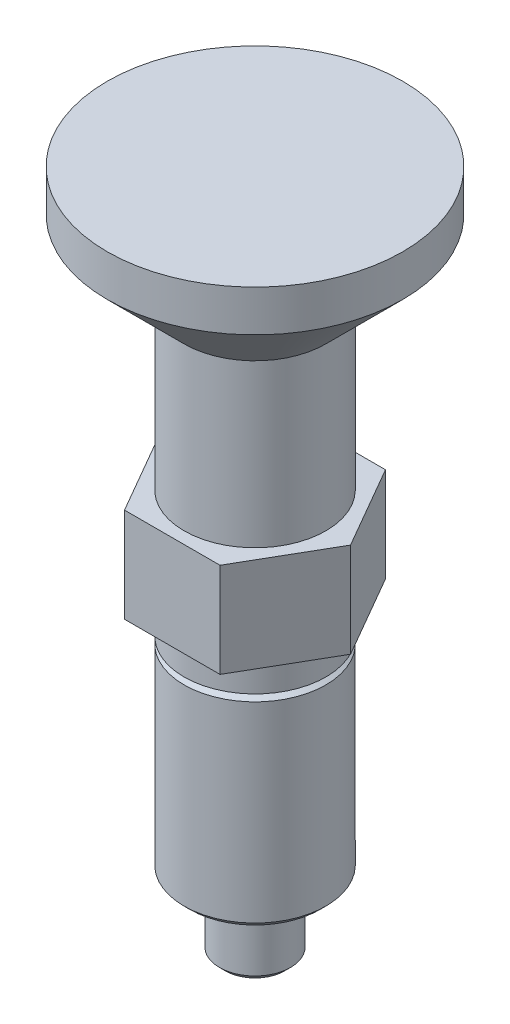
ISO-10303-21;
HEADER;
FILE_DESCRIPTION(('STEP AP214'),'2;1');
FILE_NAME('part.step','',(''),(''),'','','');
FILE_SCHEMA(('AUTOMOTIVE_DESIGN { 1 0 10303 214 1 1 1 1 }'));
ENDSEC;
DATA;
#1=APPLICATION_CONTEXT('core data for automotive mechanical design processes');
#2=APPLICATION_PROTOCOL_DEFINITION('international standard','automotive_design',2000,#1);
#3=PRODUCT_CONTEXT('',#1,'mechanical');
#4=PRODUCT('Part','Part','',(#3));
#5=PRODUCT_RELATED_PRODUCT_CATEGORY('part','',(#4));
#6=PRODUCT_DEFINITION_FORMATION('','',#4);
#7=PRODUCT_DEFINITION_CONTEXT('part definition',#1,'design');
#8=PRODUCT_DEFINITION('design','',#6,#7);
#9=PRODUCT_DEFINITION_SHAPE('','',#8);
#10=(LENGTH_UNIT() NAMED_UNIT(*) SI_UNIT(.MILLI.,.METRE.));
#11=(NAMED_UNIT(*) PLANE_ANGLE_UNIT() SI_UNIT($,.RADIAN.));
#12=(NAMED_UNIT(*) SI_UNIT($,.STERADIAN.) SOLID_ANGLE_UNIT());
#13=UNCERTAINTY_MEASURE_WITH_UNIT(LENGTH_MEASURE(1.E-05),#10,'distance_accuracy_value','');
#14=(GEOMETRIC_REPRESENTATION_CONTEXT(3) GLOBAL_UNCERTAINTY_ASSIGNED_CONTEXT((#13)) GLOBAL_UNIT_ASSIGNED_CONTEXT((#10,
#11,#12)) REPRESENTATION_CONTEXT('',''));
#15=CARTESIAN_POINT('',(0.,0.,0.));
#16=DIRECTION('',(0.,0.,1.));
#17=DIRECTION('',(1.,0.,0.));
#18=AXIS2_PLACEMENT_3D('',#15,#16,#17);
#19=CARTESIAN_POINT('',(0.,-6.,0.));
#20=DIRECTION('',(0.,-1.,0.));
#21=DIRECTION('',(0.,0.,-1.));
#22=AXIS2_PLACEMENT_3D('',#19,#20,#21);
#23=PLANE('',#22);
#24=CARTESIAN_POINT('',(0.,-6.00000000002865,0.));
#25=DIRECTION('',(0.,1.,0.));
#26=DIRECTION('',(0.,0.,1.));
#27=AXIS2_PLACEMENT_3D('',#24,#25,#26);
#28=CIRCLE('',#27,2.49999999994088);
#29=CARTESIAN_POINT('',(0.,-6.00000000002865,2.49999999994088));
#30=VERTEX_POINT('',#29);
#31=EDGE_CURVE('E19',#30,#30,#28,.T.);
#32=ORIENTED_EDGE('',*,*,#31,.F.);
#33=EDGE_LOOP('',(#32));
#34=FACE_BOUND('',#33,.T.);
#35=ADVANCED_FACE('F16',(#34),#23,.T.);
#36=CARTESIAN_POINT('',(0.,-5.50000000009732,0.));
#37=DIRECTION('',(0.,1.,0.));
#38=DIRECTION('',(0.,0.,1.));
#39=AXIS2_PLACEMENT_3D('',#36,#37,#38);
#40=CONICAL_SURFACE('',#39,2.99999999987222,0.785398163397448);
#41=ORIENTED_EDGE('',*,*,#31,.T.);
#42=EDGE_LOOP('',(#41));
#43=FACE_BOUND('',#42,.T.);
#44=CARTESIAN_POINT('',(0.,-5.49999999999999,0.));
#45=DIRECTION('',(0.,1.,0.));
#46=DIRECTION('',(0.,0.,1.));
#47=AXIS2_PLACEMENT_3D('',#44,#45,#46);
#48=CIRCLE('',#47,2.99999999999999);
#49=CARTESIAN_POINT('',(0.,-5.49999999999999,2.99999999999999));
#50=VERTEX_POINT('',#49);
#51=EDGE_CURVE('E110',#50,#50,#48,.T.);
#52=ORIENTED_EDGE('',*,*,#51,.F.);
#53=EDGE_LOOP('',(#52));
#54=FACE_BOUND('',#53,.T.);
#55=ADVANCED_FACE('F130',(#43,#54),#40,.T.);
#56=CARTESIAN_POINT('',(0.,57.7629759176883,0.));
#57=DIRECTION('',(0.,1.,0.));
#58=DIRECTION('',(0.,0.,1.));
#59=AXIS2_PLACEMENT_3D('',#56,#57,#58);
#60=CYLINDRICAL_SURFACE('',#59,2.99999999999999);
#61=ORIENTED_EDGE('',*,*,#51,.T.);
#62=EDGE_LOOP('',(#61));
#63=FACE_BOUND('',#62,.T.);
#64=CARTESIAN_POINT('',(0.,0.,0.));
#65=DIRECTION('',(0.,1.,0.));
#66=DIRECTION('',(0.,0.,1.));
#67=AXIS2_PLACEMENT_3D('',#64,#65,#66);
#68=CIRCLE('',#67,2.99999999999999);
#69=CARTESIAN_POINT('',(0.,0.,2.99999999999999));
#70=VERTEX_POINT('',#69);
#71=EDGE_CURVE('E112',#70,#70,#68,.T.);
#72=ORIENTED_EDGE('',*,*,#71,.F.);
#73=EDGE_LOOP('',(#72));
#74=FACE_BOUND('',#73,.T.);
#75=ADVANCED_FACE('F128',(#63,#74),#60,.T.);
#76=CARTESIAN_POINT('',(-2.99999999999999,0.,0.));
#77=DIRECTION('',(0.,-1.,0.));
#78=DIRECTION('',(0.,0.,-1.));
#79=AXIS2_PLACEMENT_3D('',#76,#77,#78);
#80=PLANE('',#79);
#81=ORIENTED_EDGE('',*,*,#71,.T.);
#82=EDGE_LOOP('',(#81));
#83=FACE_BOUND('',#82,.T.);
#84=CARTESIAN_POINT('',(0.,5.6843418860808E-11,0.));
#85=DIRECTION('',(0.,1.,0.));
#86=DIRECTION('',(0.,0.,1.));
#87=AXIS2_PLACEMENT_3D('',#84,#85,#86);
#88=CIRCLE('',#87,5.49999999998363);
#89=CARTESIAN_POINT('',(0.,5.6843418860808E-11,5.49999999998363));
#90=VERTEX_POINT('',#89);
#91=EDGE_CURVE('E109',#90,#90,#88,.T.);
#92=ORIENTED_EDGE('',*,*,#91,.F.);
#93=EDGE_LOOP('',(#92));
#94=FACE_BOUND('',#93,.T.);
#95=ADVANCED_FACE('F125',(#83,#94),#80,.T.);
#96=CARTESIAN_POINT('',(0.,0.50000000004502,0.));
#97=DIRECTION('',(0.,1.,0.));
#98=DIRECTION('',(0.,0.,1.));
#99=AXIS2_PLACEMENT_3D('',#96,#97,#98);
#100=CONICAL_SURFACE('',#99,5.99999999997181,0.785398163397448);
#101=ORIENTED_EDGE('',*,*,#91,.T.);
#102=EDGE_LOOP('',(#101));
#103=FACE_BOUND('',#102,.T.);
#104=CARTESIAN_POINT('',(0.,0.5,0.));
#105=DIRECTION('',(0.,1.,0.));
#106=DIRECTION('',(0.,0.,1.));
#107=AXIS2_PLACEMENT_3D('',#104,#105,#106);
#108=CIRCLE('',#107,5.99999999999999);
#109=CARTESIAN_POINT('',(0.,0.5,5.99999999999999));
#110=VERTEX_POINT('',#109);
#111=EDGE_CURVE('E106',#110,#110,#108,.T.);
#112=ORIENTED_EDGE('',*,*,#111,.F.);
#113=EDGE_LOOP('',(#112));
#114=FACE_BOUND('',#113,.T.);
#115=ADVANCED_FACE('F138',(#103,#114),#100,.T.);
#116=CARTESIAN_POINT('',(0.,57.7629759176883,0.));
#117=DIRECTION('',(0.,1.,0.));
#118=DIRECTION('',(0.,0.,1.));
#119=AXIS2_PLACEMENT_3D('',#116,#117,#118);
#120=CYLINDRICAL_SURFACE('',#119,5.99999999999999);
#121=ORIENTED_EDGE('',*,*,#111,.T.);
#122=EDGE_LOOP('',(#121));
#123=FACE_BOUND('',#122,.T.);
#124=CARTESIAN_POINT('',(0.,16.7113248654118,0.));
#125=DIRECTION('',(0.,-1.,0.));
#126=DIRECTION('',(0.,0.,-1.));
#127=AXIS2_PLACEMENT_3D('',#124,#125,#126);
#128=CIRCLE('',#127,6.00000000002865);
#129=CARTESIAN_POINT('',(0.,16.7113248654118,-6.00000000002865));
#130=VERTEX_POINT('',#129);
#131=EDGE_CURVE('E103',#130,#130,#128,.F.);
#132=ORIENTED_EDGE('',*,*,#131,.F.);
#133=EDGE_LOOP('',(#132));
#134=FACE_BOUND('',#133,.T.);
#135=ADVANCED_FACE('F196',(#123,#134),#120,.T.);
#136=CARTESIAN_POINT('',(0.,16.7113248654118,0.));
#137=DIRECTION('',(0.,-1.,0.));
#138=DIRECTION('',(0.,0.,-1.));
#139=AXIS2_PLACEMENT_3D('',#136,#137,#138);
#140=CONICAL_SURFACE('',#139,6.00000000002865,1.04719755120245);
#141=CARTESIAN_POINT('',(0.,16.9999999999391,0.));
#142=DIRECTION('',(0.,1.,0.));
#143=DIRECTION('',(0.,0.,1.));
#144=AXIS2_PLACEMENT_3D('',#141,#142,#143);
#145=CIRCLE('',#144,5.49999999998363);
#146=CARTESIAN_POINT('',(0.,16.9999999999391,5.49999999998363));
#147=VERTEX_POINT('',#146);
#148=EDGE_CURVE('E100',#147,#147,#145,.T.);
#149=ORIENTED_EDGE('',*,*,#148,.F.);
#150=EDGE_LOOP('',(#149));
#151=FACE_BOUND('',#150,.T.);
#152=ORIENTED_EDGE('',*,*,#131,.T.);
#153=EDGE_LOOP('',(#152));
#154=FACE_BOUND('',#153,.T.);
#155=ADVANCED_FACE('F192',(#151,#154),#140,.T.);
#156=CARTESIAN_POINT('',(0.,17.28867513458,0.));
#157=DIRECTION('',(0.,1.,0.));
#158=DIRECTION('',(0.,0.,1.));
#159=AXIS2_PLACEMENT_3D('',#156,#157,#158);
#160=CONICAL_SURFACE('',#159,6.00000000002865,1.04719755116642);
#161=ORIENTED_EDGE('',*,*,#148,.T.);
#162=EDGE_LOOP('',(#161));
#163=FACE_BOUND('',#162,.T.);
#164=CARTESIAN_POINT('',(0.,17.2886751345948,0.));
#165=DIRECTION('',(0.,1.,0.));
#166=DIRECTION('',(0.,0.,1.));
#167=AXIS2_PLACEMENT_3D('',#164,#165,#166);
#168=CIRCLE('',#167,5.99999999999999);
#169=CARTESIAN_POINT('',(0.,17.2886751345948,5.99999999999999));
#170=VERTEX_POINT('',#169);
#171=EDGE_CURVE('E97',#170,#170,#168,.T.);
#172=ORIENTED_EDGE('',*,*,#171,.F.);
#173=EDGE_LOOP('',(#172));
#174=FACE_BOUND('',#173,.T.);
#175=ADVANCED_FACE('F188',(#163,#174),#160,.T.);
#176=CARTESIAN_POINT('',(0.,57.7629759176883,0.));
#177=DIRECTION('',(0.,1.,0.));
#178=DIRECTION('',(0.,0.,1.));
#179=AXIS2_PLACEMENT_3D('',#176,#177,#178);
#180=CYLINDRICAL_SURFACE('',#179,5.99999999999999);
#181=ORIENTED_EDGE('',*,*,#171,.T.);
#182=EDGE_LOOP('',(#181));
#183=FACE_BOUND('',#182,.T.);
#184=CARTESIAN_POINT('',(0.,20.,0.));
#185=DIRECTION('',(0.,1.,0.));
#186=DIRECTION('',(0.,0.,1.));
#187=AXIS2_PLACEMENT_3D('',#184,#185,#186);
#188=CIRCLE('',#187,5.99999999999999);
#189=CARTESIAN_POINT('',(0.,20.,5.99999999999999));
#190=VERTEX_POINT('',#189);
#191=EDGE_CURVE('E80',#190,#190,#188,.T.);
#192=ORIENTED_EDGE('',*,*,#191,.F.);
#193=EDGE_LOOP('',(#192));
#194=FACE_BOUND('',#193,.T.);
#195=ADVANCED_FACE('F185',(#183,#194),#180,.T.);
#196=CARTESIAN_POINT('',(-5.99999999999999,20.,0.));
#197=DIRECTION('',(0.,-1.,0.));
#198=DIRECTION('',(0.,0.,-1.));
#199=AXIS2_PLACEMENT_3D('',#196,#197,#198);
#200=PLANE('',#199);
#201=DIRECTION('',(0.5,0.,0.866025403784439));
#202=VECTOR('',#201,1.);
#203=CARTESIAN_POINT('',(-4.04145188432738,20.,7.));
#204=LINE('',#203,#202);
#205=CARTESIAN_POINT('',(-8.08290376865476,20.,0.));
#206=VERTEX_POINT('',#205);
#207=CARTESIAN_POINT('',(-4.04145188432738,20.,7.));
#208=VERTEX_POINT('',#207);
#209=EDGE_CURVE('E360',#206,#208,#204,.T.);
#210=ORIENTED_EDGE('',*,*,#209,.F.);
#211=DIRECTION('',(-0.5,0.,0.866025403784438));
#212=VECTOR('',#211,1.);
#213=CARTESIAN_POINT('',(-8.08290376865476,20.,0.));
#214=LINE('',#213,#212);
#215=CARTESIAN_POINT('',(-4.04145188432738,20.,-7.));
#216=VERTEX_POINT('',#215);
#217=EDGE_CURVE('E359',#216,#206,#214,.T.);
#218=ORIENTED_EDGE('',*,*,#217,.F.);
#219=DIRECTION('',(-1.,0.,0.));
#220=VECTOR('',#219,1.);
#221=CARTESIAN_POINT('',(-4.04145188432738,20.,-7.));
#222=LINE('',#221,#220);
#223=CARTESIAN_POINT('',(4.04145188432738,20.,-7.));
#224=VERTEX_POINT('',#223);
#225=EDGE_CURVE('E86',#224,#216,#222,.T.);
#226=ORIENTED_EDGE('',*,*,#225,.F.);
#227=DIRECTION('',(-0.5,0.,-0.866025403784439));
#228=VECTOR('',#227,1.);
#229=CARTESIAN_POINT('',(4.04145188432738,20.,-7.));
#230=LINE('',#229,#228);
#231=CARTESIAN_POINT('',(8.08290376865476,20.,0.));
#232=VERTEX_POINT('',#231);
#233=EDGE_CURVE('E66',#232,#224,#230,.T.);
#234=ORIENTED_EDGE('',*,*,#233,.F.);
#235=DIRECTION('',(0.5,0.,-0.866025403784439));
#236=VECTOR('',#235,1.);
#237=CARTESIAN_POINT('',(8.08290376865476,20.,0.));
#238=LINE('',#237,#236);
#239=CARTESIAN_POINT('',(4.04145188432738,20.,7.));
#240=VERTEX_POINT('',#239);
#241=EDGE_CURVE('E71',#240,#232,#238,.T.);
#242=ORIENTED_EDGE('',*,*,#241,.F.);
#243=DIRECTION('',(1.,0.,0.));
#244=VECTOR('',#243,1.);
#245=CARTESIAN_POINT('',(4.04145188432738,20.,7.));
#246=LINE('',#245,#244);
#247=EDGE_CURVE('E372',#208,#240,#246,.T.);
#248=ORIENTED_EDGE('',*,*,#247,.F.);
#249=EDGE_LOOP('',(#210,#218,#226,#234,#242,#248));
#250=FACE_BOUND('',#249,.T.);
#251=ORIENTED_EDGE('',*,*,#191,.T.);
#252=EDGE_LOOP('',(#251));
#253=FACE_BOUND('',#252,.T.);
#254=ADVANCED_FACE('F83',(#250,#253),#200,.T.);
#255=CARTESIAN_POINT('',(8.08290376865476,64.7695526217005,0.));
#256=DIRECTION('',(0.866025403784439,0.,0.5));
#257=DIRECTION('',(0.5,0.,-0.866025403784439));
#258=AXIS2_PLACEMENT_3D('',#255,#256,#257);
#259=PLANE('',#258);
#260=ORIENTED_EDGE('',*,*,#241,.T.);
#261=DIRECTION('',(0.,1.,0.));
#262=VECTOR('',#261,1.);
#263=CARTESIAN_POINT('',(8.08290376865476,64.7695526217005,0.));
#264=LINE('',#263,#262);
#265=CARTESIAN_POINT('',(8.08290376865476,28.,0.));
#266=VERTEX_POINT('',#265);
#267=EDGE_CURVE('E73',#266,#232,#264,.F.);
#268=ORIENTED_EDGE('',*,*,#267,.F.);
#269=DIRECTION('',(0.500000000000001,0.,-0.866025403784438));
#270=VECTOR('',#269,1.);
#271=CARTESIAN_POINT('',(4.04145188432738,28.,7.));
#272=LINE('',#271,#270);
#273=CARTESIAN_POINT('',(4.04145188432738,28.,7.));
#274=VERTEX_POINT('',#273);
#275=EDGE_CURVE('E375',#274,#266,#272,.T.);
#276=ORIENTED_EDGE('',*,*,#275,.F.);
#277=DIRECTION('',(0.,1.,0.));
#278=VECTOR('',#277,1.);
#279=CARTESIAN_POINT('',(4.04145188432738,64.7695526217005,7.));
#280=LINE('',#279,#278);
#281=EDGE_CURVE('E76',#240,#274,#280,.T.);
#282=ORIENTED_EDGE('',*,*,#281,.F.);
#283=EDGE_LOOP('',(#260,#268,#276,#282));
#284=FACE_BOUND('',#283,.T.);
#285=ADVANCED_FACE('F72',(#284),#259,.T.);
#286=CARTESIAN_POINT('',(4.04145188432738,64.7695526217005,-7.));
#287=DIRECTION('',(0.866025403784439,0.,-0.5));
#288=DIRECTION('',(-0.5,0.,-0.866025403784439));
#289=AXIS2_PLACEMENT_3D('',#286,#287,#288);
#290=PLANE('',#289);
#291=ORIENTED_EDGE('',*,*,#233,.T.);
#292=DIRECTION('',(0.,1.,0.));
#293=VECTOR('',#292,1.);
#294=CARTESIAN_POINT('',(4.04145188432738,64.7695526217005,-7.));
#295=LINE('',#294,#293);
#296=CARTESIAN_POINT('',(4.04145188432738,28.,-7.));
#297=VERTEX_POINT('',#296);
#298=EDGE_CURVE('E88',#297,#224,#295,.F.);
#299=ORIENTED_EDGE('',*,*,#298,.F.);
#300=DIRECTION('',(-0.5,0.,-0.866025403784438));
#301=VECTOR('',#300,1.);
#302=CARTESIAN_POINT('',(8.08290376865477,28.,0.));
#303=LINE('',#302,#301);
#304=EDGE_CURVE('E92',#266,#297,#303,.T.);
#305=ORIENTED_EDGE('',*,*,#304,.F.);
#306=ORIENTED_EDGE('',*,*,#267,.T.);
#307=EDGE_LOOP('',(#291,#299,#305,#306));
#308=FACE_BOUND('',#307,.T.);
#309=ADVANCED_FACE('F90',(#308),#290,.T.);
#310=CARTESIAN_POINT('',(-4.04145188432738,64.7695526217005,-7.));
#311=DIRECTION('',(0.,0.,-1.));
#312=DIRECTION('',(-1.,0.,0.));
#313=AXIS2_PLACEMENT_3D('',#310,#311,#312);
#314=PLANE('',#313);
#315=ORIENTED_EDGE('',*,*,#225,.T.);
#316=DIRECTION('',(0.,1.,0.));
#317=VECTOR('',#316,1.);
#318=CARTESIAN_POINT('',(-4.04145188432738,64.7695526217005,-7.));
#319=LINE('',#318,#317);
#320=CARTESIAN_POINT('',(-4.04145188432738,28.,-7.));
#321=VERTEX_POINT('',#320);
#322=EDGE_CURVE('E356',#321,#216,#319,.F.);
#323=ORIENTED_EDGE('',*,*,#322,.F.);
#324=DIRECTION('',(1.,0.,0.));
#325=VECTOR('',#324,1.);
#326=CARTESIAN_POINT('',(-13.,28.,-7.));
#327=LINE('',#326,#325);
#328=EDGE_CURVE('E378',#297,#321,#327,.F.);
#329=ORIENTED_EDGE('',*,*,#328,.F.);
#330=ORIENTED_EDGE('',*,*,#298,.T.);
#331=EDGE_LOOP('',(#315,#323,#329,#330));
#332=FACE_BOUND('',#331,.T.);
#333=ADVANCED_FACE('F174',(#332),#314,.T.);
#334=CARTESIAN_POINT('',(-8.08290376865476,64.7695526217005,0.));
#335=DIRECTION('',(-0.866025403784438,0.,-0.5));
#336=DIRECTION('',(-0.5,0.,0.866025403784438));
#337=AXIS2_PLACEMENT_3D('',#334,#335,#336);
#338=PLANE('',#337);
#339=ORIENTED_EDGE('',*,*,#217,.T.);
#340=DIRECTION('',(0.,1.,0.));
#341=VECTOR('',#340,1.);
#342=CARTESIAN_POINT('',(-8.08290376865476,64.7695526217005,0.));
#343=LINE('',#342,#341);
#344=CARTESIAN_POINT('',(-8.08290376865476,28.,0.));
#345=VERTEX_POINT('',#344);
#346=EDGE_CURVE('E362',#345,#206,#343,.F.);
#347=ORIENTED_EDGE('',*,*,#346,.F.);
#348=DIRECTION('',(-0.5,0.,0.866025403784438));
#349=VECTOR('',#348,1.);
#350=CARTESIAN_POINT('',(-4.04145188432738,28.,-7.));
#351=LINE('',#350,#349);
#352=EDGE_CURVE('E365',#321,#345,#351,.T.);
#353=ORIENTED_EDGE('',*,*,#352,.F.);
#354=ORIENTED_EDGE('',*,*,#322,.T.);
#355=EDGE_LOOP('',(#339,#347,#353,#354));
#356=FACE_BOUND('',#355,.T.);
#357=ADVANCED_FACE('F171',(#356),#338,.T.);
#358=CARTESIAN_POINT('',(-4.04145188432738,64.7695526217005,7.));
#359=DIRECTION('',(-0.866025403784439,0.,0.5));
#360=DIRECTION('',(0.5,0.,0.866025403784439));
#361=AXIS2_PLACEMENT_3D('',#358,#359,#360);
#362=PLANE('',#361);
#363=ORIENTED_EDGE('',*,*,#209,.T.);
#364=DIRECTION('',(0.,1.,0.));
#365=VECTOR('',#364,1.);
#366=CARTESIAN_POINT('',(-4.04145188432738,64.7695526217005,7.));
#367=LINE('',#366,#365);
#368=CARTESIAN_POINT('',(-4.04145188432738,28.,7.));
#369=VERTEX_POINT('',#368);
#370=EDGE_CURVE('E34',#369,#208,#367,.F.);
#371=ORIENTED_EDGE('',*,*,#370,.F.);
#372=DIRECTION('',(0.5,0.,0.866025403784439));
#373=VECTOR('',#372,1.);
#374=CARTESIAN_POINT('',(-8.08290376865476,28.,0.));
#375=LINE('',#374,#373);
#376=EDGE_CURVE('E381',#345,#369,#375,.T.);
#377=ORIENTED_EDGE('',*,*,#376,.F.);
#378=ORIENTED_EDGE('',*,*,#346,.T.);
#379=EDGE_LOOP('',(#363,#371,#377,#378));
#380=FACE_BOUND('',#379,.T.);
#381=ADVANCED_FACE('F167',(#380),#362,.T.);
#382=CARTESIAN_POINT('',(4.04145188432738,64.7695526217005,7.));
#383=DIRECTION('',(0.,0.,1.));
#384=DIRECTION('',(1.,0.,0.));
#385=AXIS2_PLACEMENT_3D('',#382,#383,#384);
#386=PLANE('',#385);
#387=ORIENTED_EDGE('',*,*,#247,.T.);
#388=ORIENTED_EDGE('',*,*,#281,.T.);
#389=DIRECTION('',(1.,0.,0.));
#390=VECTOR('',#389,1.);
#391=CARTESIAN_POINT('',(-13.,28.,7.));
#392=LINE('',#391,#390);
#393=EDGE_CURVE('E118',#369,#274,#392,.T.);
#394=ORIENTED_EDGE('',*,*,#393,.F.);
#395=ORIENTED_EDGE('',*,*,#370,.T.);
#396=EDGE_LOOP('',(#387,#388,#394,#395));
#397=FACE_BOUND('',#396,.T.);
#398=ADVANCED_FACE('F163',(#397),#386,.T.);
#399=CARTESIAN_POINT('',(-13.,28.,0.));
#400=DIRECTION('',(0.,1.,0.));
#401=DIRECTION('',(0.,0.,1.));
#402=AXIS2_PLACEMENT_3D('',#399,#400,#401);
#403=PLANE('',#402);
#404=ORIENTED_EDGE('',*,*,#376,.T.);
#405=ORIENTED_EDGE('',*,*,#393,.T.);
#406=ORIENTED_EDGE('',*,*,#275,.T.);
#407=ORIENTED_EDGE('',*,*,#304,.T.);
#408=ORIENTED_EDGE('',*,*,#328,.T.);
#409=ORIENTED_EDGE('',*,*,#352,.T.);
#410=EDGE_LOOP('',(#404,#405,#406,#407,#408,#409));
#411=FACE_BOUND('',#410,.T.);
#412=CARTESIAN_POINT('',(0.,28.,0.));
#413=DIRECTION('',(0.,1.,0.));
#414=DIRECTION('',(0.,0.,1.));
#415=AXIS2_PLACEMENT_3D('',#412,#413,#414);
#416=CIRCLE('',#415,5.99999999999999);
#417=CARTESIAN_POINT('',(0.,28.,5.99999999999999));
#418=VERTEX_POINT('',#417);
#419=EDGE_CURVE('E114',#418,#418,#416,.T.);
#420=ORIENTED_EDGE('',*,*,#419,.F.);
#421=EDGE_LOOP('',(#420));
#422=FACE_BOUND('',#421,.T.);
#423=ADVANCED_FACE('F159',(#411,#422),#403,.T.);
#424=CARTESIAN_POINT('',(0.,57.7629759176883,0.));
#425=DIRECTION('',(0.,1.,0.));
#426=DIRECTION('',(0.,0.,1.));
#427=AXIS2_PLACEMENT_3D('',#424,#425,#426);
#428=CYLINDRICAL_SURFACE('',#427,5.99999999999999);
#429=ORIENTED_EDGE('',*,*,#419,.T.);
#430=EDGE_LOOP('',(#429));
#431=FACE_BOUND('',#430,.T.);
#432=CARTESIAN_POINT('',(0.,41.7,0.));
#433=DIRECTION('',(0.,1.,0.));
#434=DIRECTION('',(0.,0.,1.));
#435=AXIS2_PLACEMENT_3D('',#432,#433,#434);
#436=CIRCLE('',#435,5.99999999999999);
#437=CARTESIAN_POINT('',(0.,41.7,5.99999999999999));
#438=VERTEX_POINT('',#437);
#439=EDGE_CURVE('E117',#438,#438,#436,.T.);
#440=ORIENTED_EDGE('',*,*,#439,.F.);
#441=EDGE_LOOP('',(#440));
#442=FACE_BOUND('',#441,.T.);
#443=ADVANCED_FACE('F155',(#431,#442),#428,.T.);
#444=CARTESIAN_POINT('',(0.,48.2,0.));
#445=DIRECTION('',(0.,1.,0.));
#446=DIRECTION('',(-1.,0.,0.));
#447=AXIS2_PLACEMENT_3D('',#444,#445,#446);
#448=CONICAL_SURFACE('',#447,12.5,0.785398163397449);
#449=ORIENTED_EDGE('',*,*,#439,.T.);
#450=EDGE_LOOP('',(#449));
#451=FACE_BOUND('',#450,.T.);
#452=CARTESIAN_POINT('',(0.,48.2,0.));
#453=DIRECTION('',(0.,1.,0.));
#454=DIRECTION('',(0.,0.,1.));
#455=AXIS2_PLACEMENT_3D('',#452,#453,#454);
#456=CIRCLE('',#455,12.5);
#457=CARTESIAN_POINT('',(0.,48.2,12.5));
#458=VERTEX_POINT('',#457);
#459=EDGE_CURVE('E25',#458,#458,#456,.T.);
#460=ORIENTED_EDGE('',*,*,#459,.F.);
#461=EDGE_LOOP('',(#460));
#462=FACE_BOUND('',#461,.T.);
#463=ADVANCED_FACE('F149',(#451,#462),#448,.T.);
#464=CARTESIAN_POINT('',(0.,57.7629759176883,0.));
#465=DIRECTION('',(0.,1.,0.));
#466=DIRECTION('',(0.,0.,1.));
#467=AXIS2_PLACEMENT_3D('',#464,#465,#466);
#468=CYLINDRICAL_SURFACE('',#467,12.5);
#469=ORIENTED_EDGE('',*,*,#459,.T.);
#470=EDGE_LOOP('',(#469));
#471=FACE_BOUND('',#470,.T.);
#472=CARTESIAN_POINT('',(0.,51.7,0.));
#473=DIRECTION('',(0.,1.,0.));
#474=DIRECTION('',(0.,0.,1.));
#475=AXIS2_PLACEMENT_3D('',#472,#473,#474);
#476=CIRCLE('',#475,12.5);
#477=CARTESIAN_POINT('',(0.,51.7,12.5));
#478=VERTEX_POINT('',#477);
#479=EDGE_CURVE('E11',#478,#478,#476,.T.);
#480=ORIENTED_EDGE('',*,*,#479,.F.);
#481=EDGE_LOOP('',(#480));
#482=FACE_BOUND('',#481,.T.);
#483=ADVANCED_FACE('F143',(#471,#482),#468,.T.);
#484=CARTESIAN_POINT('',(-12.5,51.7,0.));
#485=DIRECTION('',(0.,1.,0.));
#486=DIRECTION('',(0.,0.,1.));
#487=AXIS2_PLACEMENT_3D('',#484,#485,#486);
#488=PLANE('',#487);
#489=ORIENTED_EDGE('',*,*,#479,.T.);
#490=EDGE_LOOP('',(#489));
#491=FACE_BOUND('',#490,.T.);
#492=ADVANCED_FACE('F141',(#491),#488,.T.);
#493=CLOSED_SHELL('',(#35,#55,#75,#95,#115,#135,#155,#175,#195,#254,#285,#309,#333,#357,#381,
#398,#423,#443,#463,#483,#492));
#494=MANIFOLD_SOLID_BREP('B1',#493);
#495=ADVANCED_BREP_SHAPE_REPRESENTATION('',(#18,#494),#14);
#496=SHAPE_DEFINITION_REPRESENTATION(#9,#495);
ENDSEC;
END-ISO-10303-21;
